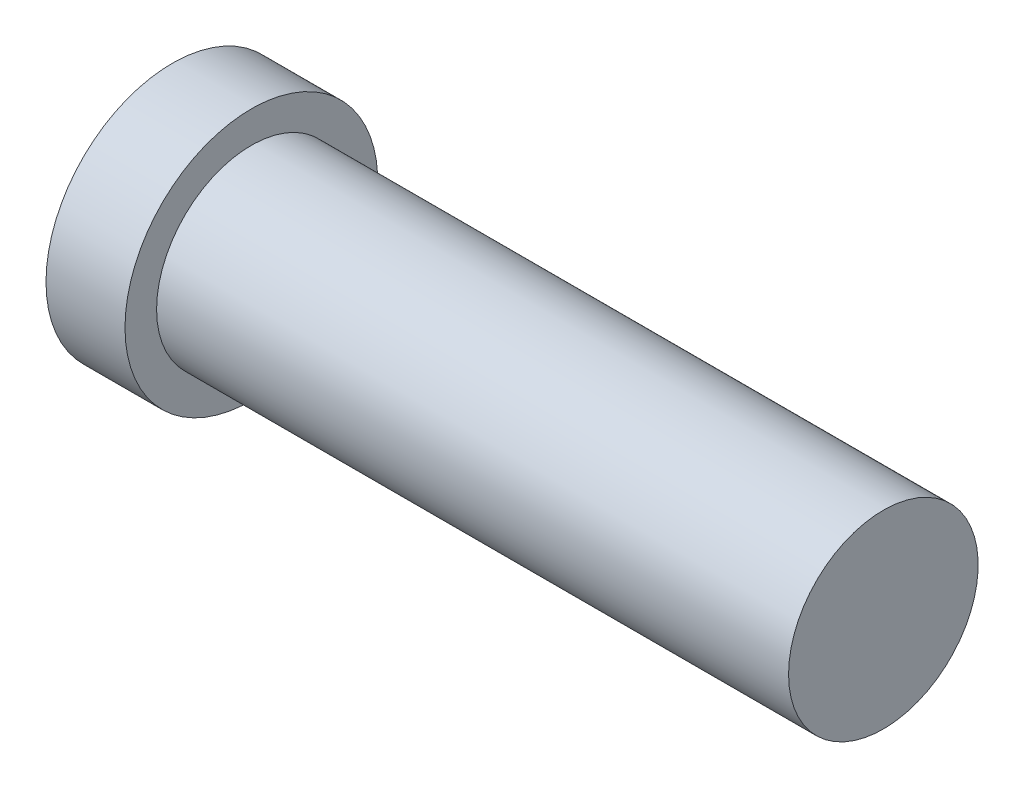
from build123d import *


with BuildPart() as part:
    # Esquisse1 → Base-R_volution (revolve)
    with BuildSketch(Plane.XY, mode=Mode.PRIVATE) as base_r_volution_sk:
        Polygon((-45, 0), (-45, 8), (-40, 8), (-40, 6), (0, 6), (0, 0), align=None)
    revolve(base_r_volution_sk.sketch.rotate(Axis((-90, 0, 0), (1, 0, 0)), 90), axis=Axis((-90, 0, 0), (1, 0, 0)))


solid = part.part
